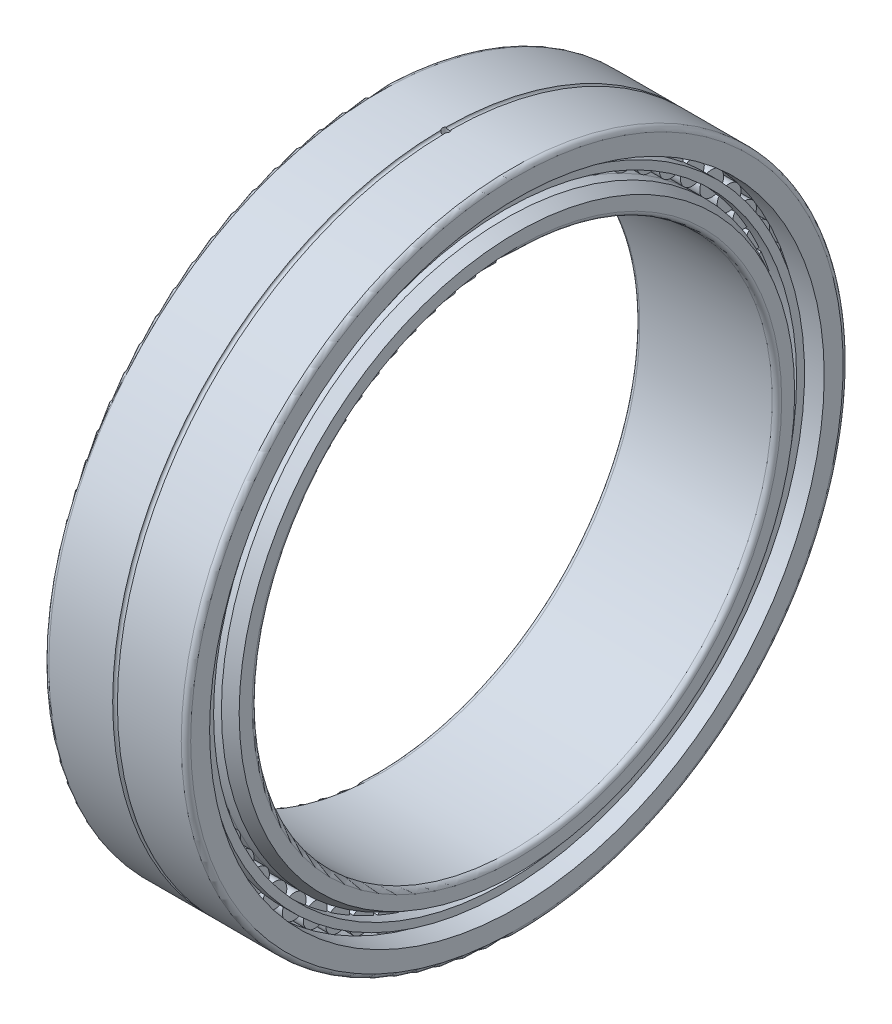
from build123d import *

# Parameters (mm, degrees)
SKETCH2_W               = 20
SKETCH2_H               = 2.52
CIRCULAR_PATTERN1_COUNT = 68
SKETCH4_W               = 25
SKETCH4_H               = 1.68
SKETCH5_R               = 0.5
SKETCH6_R               = 0.75
CUT_EXTRUDE1_DEPTH      = 5


with BuildPart() as part:
    # Sketch1 → Revolve1 (revolve)
    with BuildSketch(Plane.XY, mode=Mode.PRIVATE) as revolve1_sk:
        with BuildLine():
            Line((10, 65.02), (10, 65))
            Line((10, 65), (15, 65))
            Line((15, 65), (15, 69))
            ThreePointArc((15, 69), (14.707106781, 69.707106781), (14, 70))
            Line((14, 70), (-14, 70))
            ThreePointArc((-14, 70), (-14.707106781, 69.707106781), (-15, 69))
            Line((-15, 69), (-15, 65))
            Line((-15, 65), (-10, 65))
            Line((-10, 65), (-10, 65.02))
            Line((-10, 65.02), (10, 65.02))
        make_face()
    revolve(revolve1_sk.sketch.rotate(Axis((-15, 0, 0), (1, 0, 0)), 90), axis=Axis((-15, 0, 0), (1, 0, 0)))

    # Sketch7 → Cut-Revolve2 (revolve, cut)
    with BuildSketch(Plane.XY, mode=Mode.PRIVATE) as cut_revolve2_sk:
        with BuildLine():
            Line((-9.833333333, 66), (9.833333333, 66))
            ThreePointArc((9.833333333, 66), (10.11785113, 66.11785113), (10, 65.833333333))
            Line((10, 65.833333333), (10, 64.8))
            Line((10, 64.8), (-10, 64.8))
            Line((-10, 64.8), (-10, 65.833333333))
            ThreePointArc((-10, 65.833333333), (-10.11785113, 66.11785113), (-9.833333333, 66))
        make_face()
    revolve(cut_revolve2_sk.sketch.rotate(Axis((0, 0, 0), (1, 0, 0)), 90), axis=Axis((0, 0, 0), (1, 0, 0)), mode=Mode.SUBTRACT)

    # Sketch5 → Cut-Revolve1 (revolve, cut)
    with BuildSketch(Plane(origin=(0, 0, 0), x_dir=(1, 0, 0), z_dir=(0, 1, 0)), mode=Mode.PRIVATE) as cut_revolve1_sk:
        with Locations((0, 70)):
            Circle(SKETCH5_R)
    revolve(cut_revolve1_sk.sketch.rotate(Axis((-3.429038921, 0, 0), (1, 0, 0)), 180), axis=Axis((-3.429038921, 0, 0), (1, 0, 0)), mode=Mode.SUBTRACT)


with BuildPart() as body_2:
    # Sketch2 → Revolve2 (revolve)
    with BuildSketch(Plane.XY, mode=Mode.PRIVATE) as revolve2_sk:
        with Locations((0, 63.76)):
            Rectangle(SKETCH2_W, SKETCH2_H)
    revolve(revolve2_sk.sketch.rotate(Axis((-21.371880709, 62.5, 0), (1, 0, 0)), 90), axis=Axis((-21.371880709, 62.5, 0), (1, 0, 0)))

    # Circular-Pattern1: body 2 ×68 about axis
    circular_pattern1_axis = Axis((0, 0, 0), (1, 0, 0))


with BuildPart() as body_3:
    # Sketch1_4 → Revolve3 (revolve)
    with BuildSketch(Plane.XY, mode=Mode.PRIVATE) as revolve3_sk:
        with BuildLine():
            ThreePointArc((-15, 56), (-14.707106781, 55.292893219), (-14, 55))
            Line((-14, 55), (14, 55))
            ThreePointArc((14, 55), (14.707106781, 55.292893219), (15, 56))
            Line((15, 56), (15, 58.75))
            Line((15, 58.75), (12.5, 60))
            Line((12.5, 60), (10, 60))
            Line((10, 60), (10, 59.98))
            Line((10, 59.98), (-10, 59.98))
            Line((-10, 59.98), (-10, 60))
            Line((-10, 60), (-12.5, 60))
            Line((-12.5, 60), (-15, 58.75))
            Line((-15, 58.75), (-15, 56))
        make_face()
    revolve(revolve3_sk.sketch.rotate(Axis((-15, 0, 0), (1, 0, 0)), 90), axis=Axis((-15, 0, 0), (1, 0, 0)))


with BuildPart() as body_2_1:
    add(body_2.part)
    for i in range(1, CIRCULAR_PATTERN1_COUNT):
        add(body_2.part.rotate(circular_pattern1_axis, i * 360 / CIRCULAR_PATTERN1_COUNT))

    # Sketch4 → Revolve4 (revolve)
    with BuildSketch(Plane.XY, mode=Mode.PRIVATE) as revolve4_sk:
        with Locations((0, 62.5)):
            Rectangle(SKETCH4_W, SKETCH4_H)
    revolve(revolve4_sk.sketch.rotate(Axis((-15, 0, 0), (1, 0, 0)), 90), axis=Axis((-15, 0, 0), (1, 0, 0)))


with BuildPart() as cut_extrude1_tool:
    # Sketch6 → Cut-Extrude1 (new body)
    with BuildSketch(Plane(origin=(0, 70, 0), x_dir=(1, 0, 0), z_dir=(0, 1, 0))):
        with Locations(Location((0, 0, 0), (0, 0, 270))):
            Circle(SKETCH6_R)
    cut_extrude1 = extrude(amount=-CUT_EXTRUDE1_DEPTH)


with BuildPart() as part_1:
    add(part.part)

    # Cut-Extrude1: cut by cut_extrude1_tool
    add(cut_extrude1_tool.part, mode=Mode.SUBTRACT)


with BuildPart() as body_2_2:
    add(body_2_1.part)

    # Cut-Extrude1: cut by cut_extrude1_tool
    add(cut_extrude1_tool.part, mode=Mode.SUBTRACT)


with BuildPart() as mirror1_tool:
    # Mirror1: Cut-Extrude1 across plane
    add(cut_extrude1.mirror(Plane.ZX))


with BuildPart() as part_2:
    add(part_1.part)

    # Mirror1: cut by mirror1_tool
    add(mirror1_tool.part, mode=Mode.SUBTRACT)


with BuildPart() as body_2_3:
    add(body_2_2.part)

    # Mirror1: cut by mirror1_tool
    add(mirror1_tool.part, mode=Mode.SUBTRACT)


solid = Compound([body_3.part, part_2.part, body_2_3.part])
